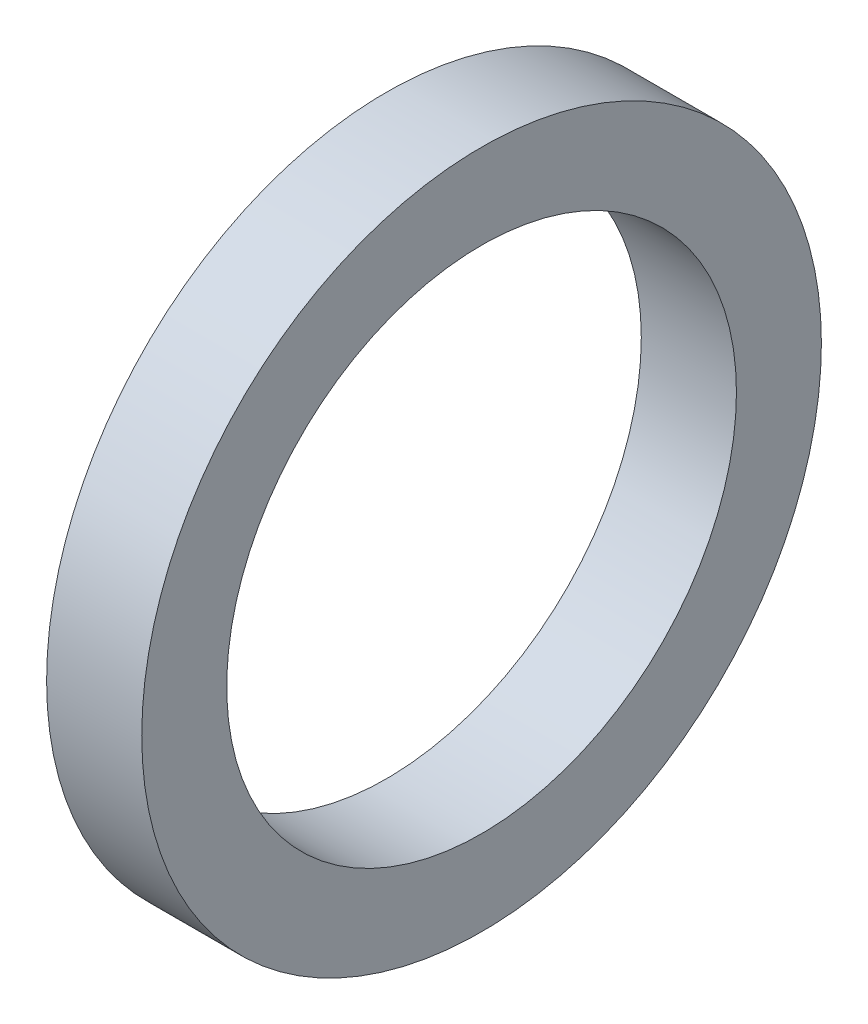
ISO-10303-21;
HEADER;
FILE_DESCRIPTION(('STEP AP214'),'2;1');
FILE_NAME('part.step','',(''),(''),'','','');
FILE_SCHEMA(('AUTOMOTIVE_DESIGN { 1 0 10303 214 1 1 1 1 }'));
ENDSEC;
DATA;
#1=APPLICATION_CONTEXT('core data for automotive mechanical design processes');
#2=APPLICATION_PROTOCOL_DEFINITION('international standard','automotive_design',2000,#1);
#3=PRODUCT_CONTEXT('',#1,'mechanical');
#4=PRODUCT('Part','Part','',(#3));
#5=PRODUCT_RELATED_PRODUCT_CATEGORY('part','',(#4));
#6=PRODUCT_DEFINITION_FORMATION('','',#4);
#7=PRODUCT_DEFINITION_CONTEXT('part definition',#1,'design');
#8=PRODUCT_DEFINITION('design','',#6,#7);
#9=PRODUCT_DEFINITION_SHAPE('','',#8);
#10=(LENGTH_UNIT() NAMED_UNIT(*) SI_UNIT(.MILLI.,.METRE.));
#11=(NAMED_UNIT(*) PLANE_ANGLE_UNIT() SI_UNIT($,.RADIAN.));
#12=(NAMED_UNIT(*) SI_UNIT($,.STERADIAN.) SOLID_ANGLE_UNIT());
#13=UNCERTAINTY_MEASURE_WITH_UNIT(LENGTH_MEASURE(1.E-05),#10,'distance_accuracy_value','');
#14=(GEOMETRIC_REPRESENTATION_CONTEXT(3) GLOBAL_UNCERTAINTY_ASSIGNED_CONTEXT((#13)) GLOBAL_UNIT_ASSIGNED_CONTEXT((#10,
#11,#12)) REPRESENTATION_CONTEXT('',''));
#15=CARTESIAN_POINT('',(0.,0.,0.));
#16=DIRECTION('',(0.,0.,1.));
#17=DIRECTION('',(1.,0.,0.));
#18=AXIS2_PLACEMENT_3D('',#15,#16,#17);
#19=CARTESIAN_POINT('',(2.8,0.,0.));
#20=DIRECTION('',(1.,0.,0.));
#21=DIRECTION('',(0.,0.,-1.));
#22=AXIS2_PLACEMENT_3D('',#19,#20,#21);
#23=PLANE('',#22);
#24=CARTESIAN_POINT('',(2.8,0.,0.));
#25=DIRECTION('',(1.,0.,0.));
#26=DIRECTION('',(0.,0.,-1.));
#27=AXIS2_PLACEMENT_3D('',#24,#25,#26);
#28=CIRCLE('',#27,10.);
#29=CARTESIAN_POINT('',(2.8,0.,-10.));
#30=VERTEX_POINT('',#29);
#31=EDGE_CURVE('E10',#30,#30,#28,.T.);
#32=ORIENTED_EDGE('',*,*,#31,.T.);
#33=EDGE_LOOP('',(#32));
#34=FACE_BOUND('',#33,.T.);
#35=CARTESIAN_POINT('',(2.8,0.,0.));
#36=DIRECTION('',(1.,0.,0.));
#37=DIRECTION('',(0.,0.,-1.));
#38=AXIS2_PLACEMENT_3D('',#35,#36,#37);
#39=CIRCLE('',#38,7.5);
#40=CARTESIAN_POINT('',(2.8,0.,-7.5));
#41=VERTEX_POINT('',#40);
#42=EDGE_CURVE('E50',#41,#41,#39,.T.);
#43=ORIENTED_EDGE('',*,*,#42,.F.);
#44=EDGE_LOOP('',(#43));
#45=FACE_BOUND('',#44,.T.);
#46=ADVANCED_FACE('F39',(#34,#45),#23,.T.);
#47=CARTESIAN_POINT('',(0.,0.,0.));
#48=DIRECTION('',(1.,0.,0.));
#49=DIRECTION('',(0.,0.,-1.));
#50=AXIS2_PLACEMENT_3D('',#47,#48,#49);
#51=PLANE('',#50);
#52=CARTESIAN_POINT('',(0.,0.,0.));
#53=DIRECTION('',(1.,0.,0.));
#54=DIRECTION('',(0.,0.,-1.));
#55=AXIS2_PLACEMENT_3D('',#52,#53,#54);
#56=CIRCLE('',#55,10.);
#57=CARTESIAN_POINT('',(0.,0.,-10.));
#58=VERTEX_POINT('',#57);
#59=EDGE_CURVE('E43',#58,#58,#56,.T.);
#60=ORIENTED_EDGE('',*,*,#59,.F.);
#61=EDGE_LOOP('',(#60));
#62=FACE_BOUND('',#61,.T.);
#63=CARTESIAN_POINT('',(0.,0.,0.));
#64=DIRECTION('',(1.,0.,0.));
#65=DIRECTION('',(0.,0.,-1.));
#66=AXIS2_PLACEMENT_3D('',#63,#64,#65);
#67=CIRCLE('',#66,7.5);
#68=CARTESIAN_POINT('',(0.,0.,-7.5));
#69=VERTEX_POINT('',#68);
#70=EDGE_CURVE('E52',#69,#69,#67,.T.);
#71=ORIENTED_EDGE('',*,*,#70,.T.);
#72=EDGE_LOOP('',(#71));
#73=FACE_BOUND('',#72,.T.);
#74=ADVANCED_FACE('F62',(#62,#73),#51,.F.);
#75=CARTESIAN_POINT('',(2.8,0.,0.));
#76=DIRECTION('',(-1.,0.,0.));
#77=DIRECTION('',(0.,0.,1.));
#78=AXIS2_PLACEMENT_3D('',#75,#76,#77);
#79=CYLINDRICAL_SURFACE('',#78,10.);
#80=ORIENTED_EDGE('',*,*,#31,.F.);
#81=EDGE_LOOP('',(#80));
#82=FACE_BOUND('',#81,.T.);
#83=ORIENTED_EDGE('',*,*,#59,.T.);
#84=EDGE_LOOP('',(#83));
#85=FACE_BOUND('',#84,.T.);
#86=ADVANCED_FACE('F41',(#82,#85),#79,.T.);
#87=CARTESIAN_POINT('',(2.8,0.,0.));
#88=DIRECTION('',(-1.,0.,0.));
#89=DIRECTION('',(0.,0.,1.));
#90=AXIS2_PLACEMENT_3D('',#87,#88,#89);
#91=CYLINDRICAL_SURFACE('',#90,7.5);
#92=ORIENTED_EDGE('',*,*,#42,.T.);
#93=EDGE_LOOP('',(#92));
#94=FACE_BOUND('',#93,.T.);
#95=ORIENTED_EDGE('',*,*,#70,.F.);
#96=EDGE_LOOP('',(#95));
#97=FACE_BOUND('',#96,.T.);
#98=ADVANCED_FACE('F58',(#94,#97),#91,.F.);
#99=CLOSED_SHELL('',(#46,#74,#86,#98));
#100=MANIFOLD_SOLID_BREP('B2',#99);
#101=ADVANCED_BREP_SHAPE_REPRESENTATION('',(#18,#100),#14);
#102=SHAPE_DEFINITION_REPRESENTATION(#9,#101);
ENDSEC;
END-ISO-10303-21;
